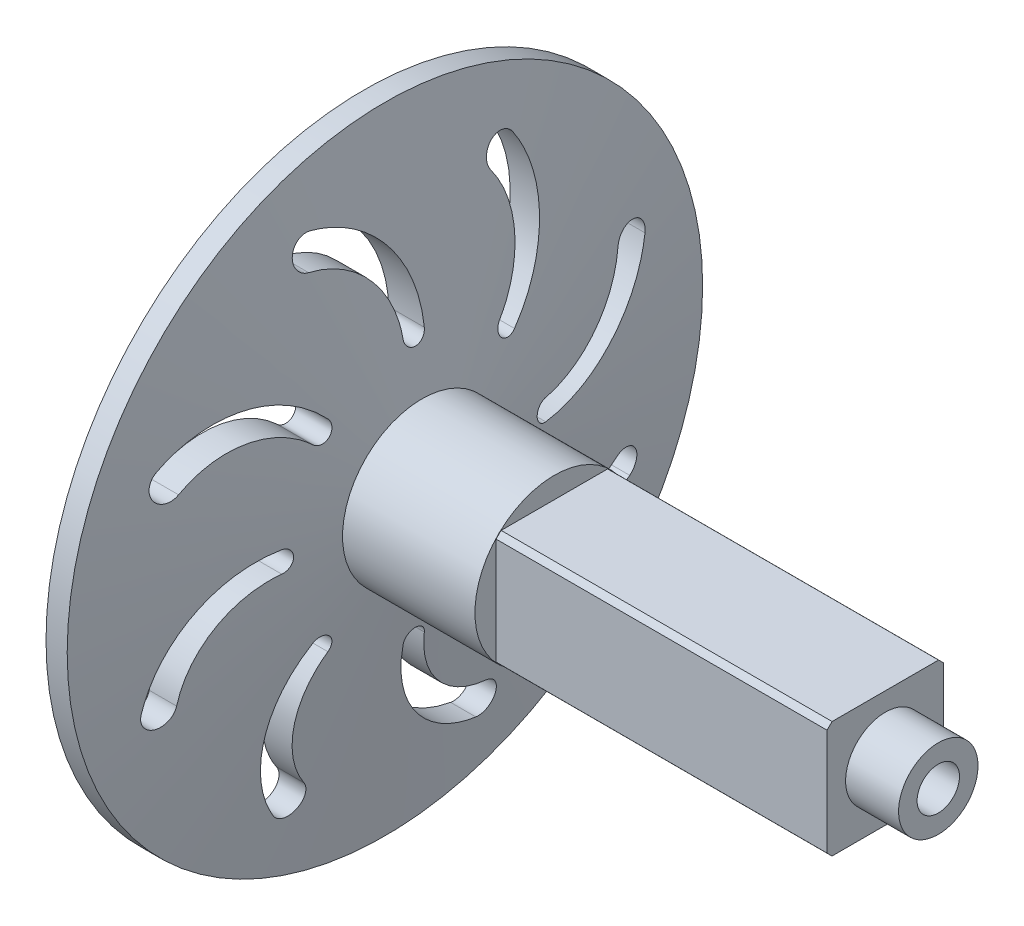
from build123d import *

# Parameters (mm, degrees)
SKETCH1_R           = 19.05
BOSS_EXTRUDE1_DEPTH = 139.7
CUT_EXTRUDE1_START  = -92.075
CUT_EXTRUDE1_DEPTH  = 92.075
CUT_EXTRUDE2_START  = -12.7
SKETCH3_R           = 9.525
CUT_EXTRUDE2_DEPTH  = 12.7
SKETCH4_R           = 5.08
CUT_EXTRUDE3_DEPTH  = 143.27401379
CUT_EXTRUDE4_DEPTH  = 44.45
CUT_EXTRUDE5_DEPTH  = 177.434038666
CIRPATTERN1_COUNT   = 8


with BuildPart() as part:
    # Sketch1 → Boss-Extrude1 (new body)
    with BuildSketch(Plane(origin=(0, 0, 0), x_dir=(0, 0, -1), z_dir=(1, 0, 0))):
        Circle(SKETCH1_R)
    extrude(amount=BOSS_EXTRUDE1_DEPTH)

    # Sketch2 → Cut-Extrude1 (cut)
    with BuildSketch(Plane(origin=(139.7, 0, 0), x_dir=(0, 0, -1), z_dir=(1, 0, 0)).offset(CUT_EXTRUDE1_START)):
        with BuildLine():
            ThreePointArc((12.763973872, 13.97), (0, 18.923), (-12.763973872, 13.97))
            Line((-12.763973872, 13.97), (12.763973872, 13.97))
        make_face()
        with BuildLine():
            Line((-13.97, -12.763973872), (-13.97, 12.763973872))
            ThreePointArc((-13.97, 12.763973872), (-18.923, 0), (-13.97, -12.763973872))
        make_face()
        with BuildLine():
            Line((12.763973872, -13.97), (-12.763973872, -13.97))
            ThreePointArc((-12.763973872, -13.97), (0, -18.923), (12.763973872, -13.97))
        make_face()
        with BuildLine():
            ThreePointArc((18.923, 0), (17.641346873, 6.845641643), (13.97, 12.763973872))
            Line((13.97, 12.763973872), (13.97, -12.763973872))
            ThreePointArc((13.97, -12.763973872), (17.641346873, -6.845641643), (18.923, 0))
        make_face()
        with BuildLine():
            Line((12.763973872, -13.97), (12.951509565, -13.97))
            ThreePointArc((12.951509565, -13.97), (13.470384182, -13.470384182), (13.97, -12.951509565))
            Line((13.97, -12.951509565), (13.97, -12.763973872))
            ThreePointArc((13.97, -12.763973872), (13.38058162, -13.38058162), (12.763973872, -13.97))
        make_face()
        with BuildLine():
            Line((-12.763973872, -13.97), (-12.951509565, -13.97))
            ThreePointArc((-12.951509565, -13.97), (0, -19.05), (12.951509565, -13.97))
            Line((12.951509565, -13.97), (12.763973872, -13.97))
            ThreePointArc((12.763973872, -13.97), (0, -18.923), (-12.763973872, -13.97))
        make_face()
        with BuildLine():
            ThreePointArc((19.05, 0), (17.734584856, 6.95607648), (13.97, 12.951509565))
            Line((13.97, 12.951509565), (13.97, 12.763973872))
            ThreePointArc((13.97, 12.763973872), (17.641346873, 6.845641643), (18.923, 0))
            ThreePointArc((18.923, 0), (17.641346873, -6.845641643), (13.97, -12.763973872))
            Line((13.97, -12.763973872), (13.97, -12.951509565))
            ThreePointArc((13.97, -12.951509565), (17.734584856, -6.95607648), (19.05, 0))
        make_face()
        with BuildLine():
            ThreePointArc((13.97, 12.951509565), (13.470384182, 13.470384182), (12.951509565, 13.97))
            Line((12.951509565, 13.97), (12.763973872, 13.97))
            ThreePointArc((12.763973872, 13.97), (13.38058162, 13.38058162), (13.97, 12.763973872))
            Line((13.97, 12.763973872), (13.97, 12.951509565))
        make_face()
        with BuildLine():
            ThreePointArc((12.951509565, 13.97), (0, 19.05), (-12.951509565, 13.97))
            Line((-12.951509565, 13.97), (-12.763973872, 13.97))
            ThreePointArc((-12.763973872, 13.97), (0, 18.923), (12.763973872, 13.97))
            Line((12.763973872, 13.97), (12.951509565, 13.97))
        make_face()
        with BuildLine():
            Line((-12.763973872, 13.97), (-12.951509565, 13.97))
            ThreePointArc((-12.951509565, 13.97), (-13.470384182, 13.470384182), (-13.97, 12.951509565))
            Line((-13.97, 12.951509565), (-13.97, 12.763973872))
            ThreePointArc((-13.97, 12.763973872), (-13.38058162, 13.38058162), (-12.763973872, 13.97))
        make_face()
        with BuildLine():
            Line((-13.97, 12.763973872), (-13.97, 12.951509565))
            ThreePointArc((-13.97, 12.951509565), (-19.05, 0), (-13.97, -12.951509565))
            Line((-13.97, -12.951509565), (-13.97, -12.763973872))
            ThreePointArc((-13.97, -12.763973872), (-18.923, 0), (-13.97, 12.763973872))
        make_face()
        with BuildLine():
            Line((-13.97, -12.763973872), (-13.97, -12.951509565))
            ThreePointArc((-13.97, -12.951509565), (-13.470384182, -13.470384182), (-12.951509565, -13.97))
            Line((-12.951509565, -13.97), (-12.763973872, -13.97))
            ThreePointArc((-12.763973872, -13.97), (-13.38058162, -13.38058162), (-13.97, -12.763973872))
        make_face()
    extrude(amount=CUT_EXTRUDE1_DEPTH, mode=Mode.SUBTRACT)

    # Sketch3 → Cut-Extrude2 (cut)
    with BuildSketch(Plane(origin=(139.7, 0, 0), x_dir=(0, 0, -1), z_dir=(1, 0, 0)).offset(CUT_EXTRUDE2_START)):
        with BuildLine():
            Line((13.97, -12.763973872), (13.97, 12.763973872))
            ThreePointArc((13.97, 12.763973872), (13.38058162, 13.38058162), (12.763973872, 13.97))
            Line((12.763973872, 13.97), (-12.763973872, 13.97))
            ThreePointArc((-12.763973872, 13.97), (-13.38058162, 13.38058162), (-13.97, 12.763973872))
            Line((-13.97, 12.763973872), (-13.97, -12.763973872))
            ThreePointArc((-13.97, -12.763973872), (-13.38058162, -13.38058162), (-12.763973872, -13.97))
            Line((-12.763973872, -13.97), (12.763973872, -13.97))
            ThreePointArc((12.763973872, -13.97), (13.38058162, -13.38058162), (13.97, -12.763973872))
        make_face()
        Circle(SKETCH3_R, mode=Mode.SUBTRACT)
    extrude(amount=CUT_EXTRUDE2_DEPTH, mode=Mode.SUBTRACT)

    # Sketch4 → Cut-Extrude3 (cut, through all)
    with BuildSketch(Plane(origin=(139.7, 0, 0), x_dir=(0, 0, -1), z_dir=(1, 0, 0))):
        Circle(SKETCH4_R)
    extrude(amount=-CUT_EXTRUDE3_DEPTH, mode=Mode.SUBTRACT)

    # Sketch5 → Revolve1 (revolve)
    with BuildSketch(Plane.XY, mode=Mode.PRIVATE) as revolve1_sk:
        Polygon((15.875, 19.05), (6.35, 19.05), (1.905, 76.2), (6.985, 76.2), align=None)
    revolve(revolve1_sk.sketch.rotate(Axis((139.7, 0, 0), (-1, 0, 0)), 270), axis=Axis((139.7, 0, 0), (-1, 0, 0)))

    # Sketch6 → Cut-Extrude4 (cut)
    with BuildSketch(Plane.ZY):
        with BuildLine():
            Line((-2.54, 12.443407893), (-2.54, 14.983407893))
            Line((-2.54, 14.983407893), (2.54, 14.983407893))
            Line((2.54, 14.983407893), (2.54, 12.443407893))
            ThreePointArc((2.54, 12.443407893), (0, -12.7), (-2.54, 12.443407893))
        make_face()
    extrude(amount=-CUT_EXTRUDE4_DEPTH, mode=Mode.SUBTRACT)

    # Sketch7 → Cut-Extrude5 (cut, through all)
    with BuildSketch(Plane.ZY):
        with BuildLine():
            ThreePointArc((-2.537967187, 31.6484), (3.392849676, 50.124458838), (19.844376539, 60.414580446))
            ThreePointArc((19.844376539, 60.414580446), (24.375320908, 57.398562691), (21.267289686, 52.930233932))
            ThreePointArc((21.267289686, 52.930233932), (8.12849088, 45.610790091), (2.537967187, 31.6484))
            ThreePointArc((2.537967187, 31.6484), (0, 29.21), (-2.537967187, 31.6484))
        make_face()
    cut_extrude5 = extrude(amount=-CUT_EXTRUDE5_DEPTH, mode=Mode.SUBTRACT)

    # CirPattern1: Cut-Extrude5 ×8 about axis
    cirpattern1_axis = Axis((0, 0, 0), (1, 0, 0))
    for i in range(1, CIRPATTERN1_COUNT):
        add(cut_extrude5.rotate(cirpattern1_axis, i * 360 / CIRPATTERN1_COUNT), mode=Mode.SUBTRACT)


solid = part.part
